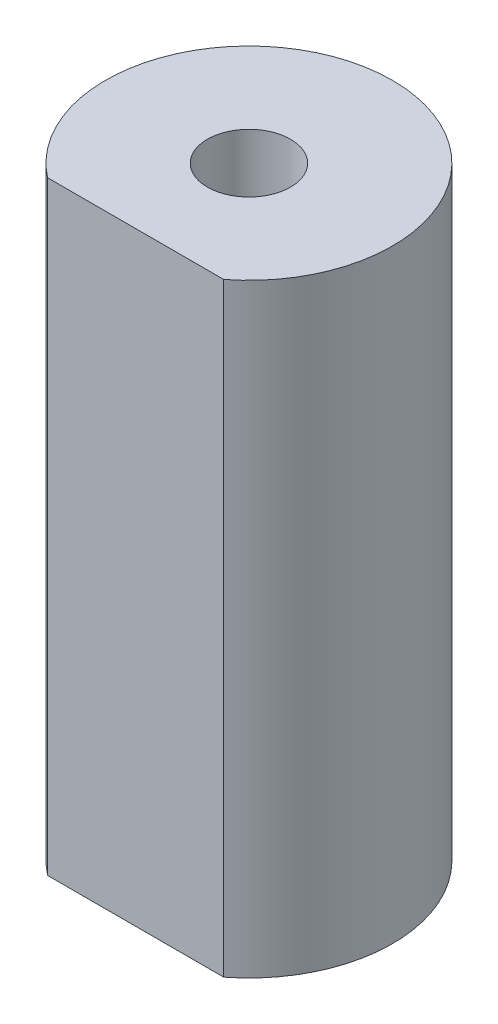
ISO-10303-21;
HEADER;
FILE_DESCRIPTION(('STEP AP214'),'2;1');
FILE_NAME('part.step','',(''),(''),'','','');
FILE_SCHEMA(('AUTOMOTIVE_DESIGN { 1 0 10303 214 1 1 1 1 }'));
ENDSEC;
DATA;
#1=APPLICATION_CONTEXT('core data for automotive mechanical design processes');
#2=APPLICATION_PROTOCOL_DEFINITION('international standard','automotive_design',2000,#1);
#3=PRODUCT_CONTEXT('',#1,'mechanical');
#4=PRODUCT('Part','Part','',(#3));
#5=PRODUCT_RELATED_PRODUCT_CATEGORY('part','',(#4));
#6=PRODUCT_DEFINITION_FORMATION('','',#4);
#7=PRODUCT_DEFINITION_CONTEXT('part definition',#1,'design');
#8=PRODUCT_DEFINITION('design','',#6,#7);
#9=PRODUCT_DEFINITION_SHAPE('','',#8);
#10=(LENGTH_UNIT() NAMED_UNIT(*) SI_UNIT(.MILLI.,.METRE.));
#11=(NAMED_UNIT(*) PLANE_ANGLE_UNIT() SI_UNIT($,.RADIAN.));
#12=(NAMED_UNIT(*) SI_UNIT($,.STERADIAN.) SOLID_ANGLE_UNIT());
#13=UNCERTAINTY_MEASURE_WITH_UNIT(LENGTH_MEASURE(1.E-05),#10,'distance_accuracy_value','');
#14=(GEOMETRIC_REPRESENTATION_CONTEXT(3) GLOBAL_UNCERTAINTY_ASSIGNED_CONTEXT((#13)) GLOBAL_UNIT_ASSIGNED_CONTEXT((#10,
#11,#12)) REPRESENTATION_CONTEXT('',''));
#15=CARTESIAN_POINT('',(0.,0.,0.));
#16=DIRECTION('',(0.,0.,1.));
#17=DIRECTION('',(1.,0.,0.));
#18=AXIS2_PLACEMENT_3D('',#15,#16,#17);
#19=CARTESIAN_POINT('',(0.,40.,0.));
#20=DIRECTION('',(0.,1.,0.));
#21=DIRECTION('',(0.,0.,1.));
#22=AXIS2_PLACEMENT_3D('',#19,#20,#21);
#23=PLANE('',#22);
#24=CARTESIAN_POINT('',(0.,40.,0.));
#25=DIRECTION('',(0.,1.,0.));
#26=DIRECTION('',(0.,0.,1.));
#27=AXIS2_PLACEMENT_3D('',#24,#25,#26);
#28=CIRCLE('',#27,9.5);
#29=CARTESIAN_POINT('',(5.8309518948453,40.,7.5));
#30=VERTEX_POINT('',#29);
#31=CARTESIAN_POINT('',(-5.8309518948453,40.,7.5));
#32=VERTEX_POINT('',#31);
#33=EDGE_CURVE('E65',#30,#32,#28,.T.);
#34=ORIENTED_EDGE('',*,*,#33,.T.);
#35=DIRECTION('',(1.,0.,0.));
#36=VECTOR('',#35,1.);
#37=CARTESIAN_POINT('',(5.8309518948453,40.,7.5));
#38=LINE('',#37,#36);
#39=EDGE_CURVE('E48',#32,#30,#38,.T.);
#40=ORIENTED_EDGE('',*,*,#39,.T.);
#41=EDGE_LOOP('',(#34,#40));
#42=FACE_BOUND('',#41,.T.);
#43=CARTESIAN_POINT('',(0.,40.,0.));
#44=DIRECTION('',(0.,1.,0.));
#45=DIRECTION('',(0.,0.,1.));
#46=AXIS2_PLACEMENT_3D('',#43,#44,#45);
#47=CIRCLE('',#46,2.75);
#48=CARTESIAN_POINT('',(0.,40.,2.75));
#49=VERTEX_POINT('',#48);
#50=EDGE_CURVE('E71',#49,#49,#47,.T.);
#51=ORIENTED_EDGE('',*,*,#50,.F.);
#52=EDGE_LOOP('',(#51));
#53=FACE_BOUND('',#52,.T.);
#54=ADVANCED_FACE('F34',(#42,#53),#23,.T.);
#55=CARTESIAN_POINT('',(0.,0.,0.));
#56=DIRECTION('',(0.,1.,0.));
#57=DIRECTION('',(0.,0.,1.));
#58=AXIS2_PLACEMENT_3D('',#55,#56,#57);
#59=PLANE('',#58);
#60=CARTESIAN_POINT('',(0.,0.,0.));
#61=DIRECTION('',(0.,1.,0.));
#62=DIRECTION('',(0.,0.,1.));
#63=AXIS2_PLACEMENT_3D('',#60,#61,#62);
#64=CIRCLE('',#63,9.5);
#65=CARTESIAN_POINT('',(5.8309518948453,0.,7.5));
#66=VERTEX_POINT('',#65);
#67=CARTESIAN_POINT('',(-5.8309518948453,0.,7.5));
#68=VERTEX_POINT('',#67);
#69=EDGE_CURVE('E63',#66,#68,#64,.T.);
#70=ORIENTED_EDGE('',*,*,#69,.F.);
#71=DIRECTION('',(1.,0.,0.));
#72=VECTOR('',#71,1.);
#73=CARTESIAN_POINT('',(5.8309518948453,0.,7.5));
#74=LINE('',#73,#72);
#75=EDGE_CURVE('E59',#68,#66,#74,.T.);
#76=ORIENTED_EDGE('',*,*,#75,.F.);
#77=EDGE_LOOP('',(#70,#76));
#78=FACE_BOUND('',#77,.T.);
#79=CARTESIAN_POINT('',(0.,0.,0.));
#80=DIRECTION('',(0.,1.,0.));
#81=DIRECTION('',(0.,0.,1.));
#82=AXIS2_PLACEMENT_3D('',#79,#80,#81);
#83=CIRCLE('',#82,2.75);
#84=CARTESIAN_POINT('',(0.,0.,2.75));
#85=VERTEX_POINT('',#84);
#86=EDGE_CURVE('E74',#85,#85,#83,.T.);
#87=ORIENTED_EDGE('',*,*,#86,.T.);
#88=EDGE_LOOP('',(#87));
#89=FACE_BOUND('',#88,.T.);
#90=ADVANCED_FACE('F60',(#78,#89),#59,.F.);
#91=CARTESIAN_POINT('',(0.,40.,0.));
#92=DIRECTION('',(0.,-1.,0.));
#93=DIRECTION('',(0.,0.,-1.));
#94=AXIS2_PLACEMENT_3D('',#91,#92,#93);
#95=CYLINDRICAL_SURFACE('',#94,9.5);
#96=ORIENTED_EDGE('',*,*,#69,.T.);
#97=DIRECTION('',(0.,-1.,0.));
#98=VECTOR('',#97,1.);
#99=CARTESIAN_POINT('',(-5.8309518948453,40.,7.5));
#100=LINE('',#99,#98);
#101=EDGE_CURVE('E11',#32,#68,#100,.T.);
#102=ORIENTED_EDGE('',*,*,#101,.F.);
#103=ORIENTED_EDGE('',*,*,#33,.F.);
#104=DIRECTION('',(0.,-1.,0.));
#105=VECTOR('',#104,1.);
#106=CARTESIAN_POINT('',(5.8309518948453,40.,7.5));
#107=LINE('',#106,#105);
#108=EDGE_CURVE('E42',#30,#66,#107,.T.);
#109=ORIENTED_EDGE('',*,*,#108,.T.);
#110=EDGE_LOOP('',(#96,#102,#103,#109));
#111=FACE_BOUND('',#110,.T.);
#112=ADVANCED_FACE('F36',(#111),#95,.T.);
#113=CARTESIAN_POINT('',(5.8309518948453,40.,7.5));
#114=DIRECTION('',(0.,0.,-1.));
#115=DIRECTION('',(-1.,0.,0.));
#116=AXIS2_PLACEMENT_3D('',#113,#114,#115);
#117=PLANE('',#116);
#118=ORIENTED_EDGE('',*,*,#75,.T.);
#119=ORIENTED_EDGE('',*,*,#108,.F.);
#120=ORIENTED_EDGE('',*,*,#39,.F.);
#121=ORIENTED_EDGE('',*,*,#101,.T.);
#122=EDGE_LOOP('',(#118,#119,#120,#121));
#123=FACE_BOUND('',#122,.T.);
#124=ADVANCED_FACE('F68',(#123),#117,.F.);
#125=CARTESIAN_POINT('',(0.,40.,0.));
#126=DIRECTION('',(0.,-1.,0.));
#127=DIRECTION('',(0.,0.,-1.));
#128=AXIS2_PLACEMENT_3D('',#125,#126,#127);
#129=CYLINDRICAL_SURFACE('',#128,2.75);
#130=ORIENTED_EDGE('',*,*,#50,.T.);
#131=EDGE_LOOP('',(#130));
#132=FACE_BOUND('',#131,.T.);
#133=ORIENTED_EDGE('',*,*,#86,.F.);
#134=EDGE_LOOP('',(#133));
#135=FACE_BOUND('',#134,.T.);
#136=ADVANCED_FACE('F84',(#132,#135),#129,.F.);
#137=CLOSED_SHELL('',(#54,#90,#112,#124,#136));
#138=MANIFOLD_SOLID_BREP('B2',#137);
#139=ADVANCED_BREP_SHAPE_REPRESENTATION('',(#18,#138),#14);
#140=SHAPE_DEFINITION_REPRESENTATION(#9,#139);
ENDSEC;
END-ISO-10303-21;
